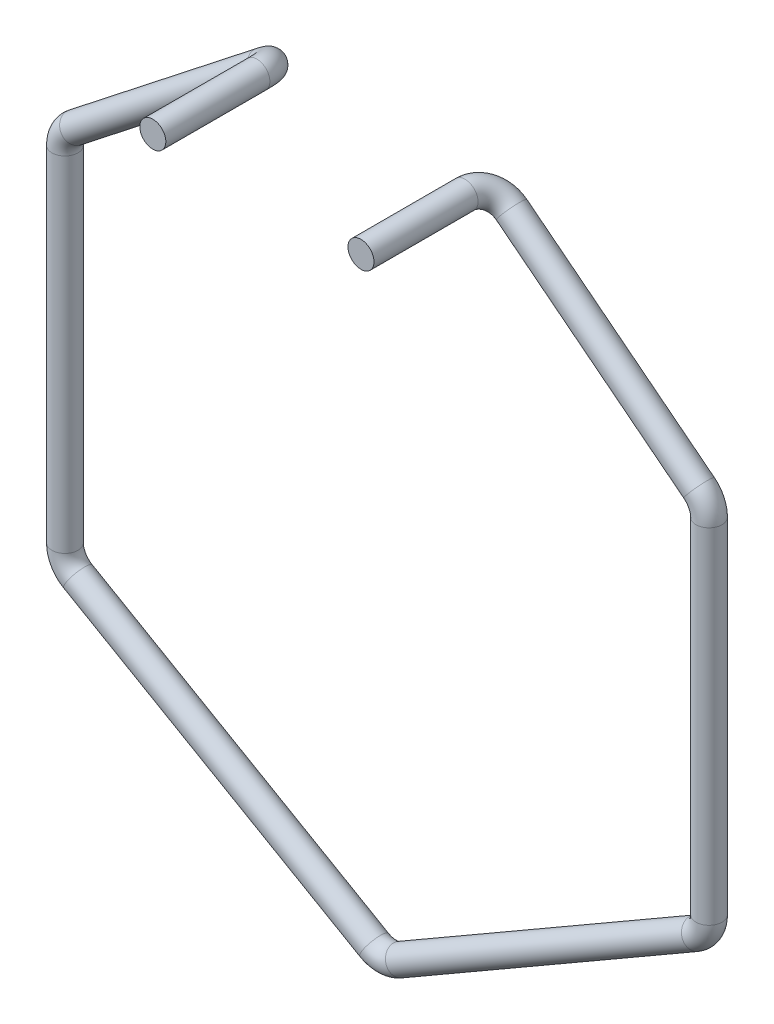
ISO-10303-21;
HEADER;
FILE_DESCRIPTION(('STEP AP214'),'2;1');
FILE_NAME('part.step','',(''),(''),'','','');
FILE_SCHEMA(('AUTOMOTIVE_DESIGN { 1 0 10303 214 1 1 1 1 }'));
ENDSEC;
DATA;
#1=APPLICATION_CONTEXT('core data for automotive mechanical design processes');
#2=APPLICATION_PROTOCOL_DEFINITION('international standard','automotive_design',2000,#1);
#3=PRODUCT_CONTEXT('',#1,'mechanical');
#4=PRODUCT('Part','Part','',(#3));
#5=PRODUCT_RELATED_PRODUCT_CATEGORY('part','',(#4));
#6=PRODUCT_DEFINITION_FORMATION('','',#4);
#7=PRODUCT_DEFINITION_CONTEXT('part definition',#1,'design');
#8=PRODUCT_DEFINITION('design','',#6,#7);
#9=PRODUCT_DEFINITION_SHAPE('','',#8);
#10=(LENGTH_UNIT() NAMED_UNIT(*) SI_UNIT(.MILLI.,.METRE.));
#11=(NAMED_UNIT(*) PLANE_ANGLE_UNIT() SI_UNIT($,.RADIAN.));
#12=(NAMED_UNIT(*) SI_UNIT($,.STERADIAN.) SOLID_ANGLE_UNIT());
#13=UNCERTAINTY_MEASURE_WITH_UNIT(LENGTH_MEASURE(1.E-05),#10,'distance_accuracy_value','');
#14=(GEOMETRIC_REPRESENTATION_CONTEXT(3) GLOBAL_UNCERTAINTY_ASSIGNED_CONTEXT((#13)) GLOBAL_UNIT_ASSIGNED_CONTEXT((#10,
#11,#12)) REPRESENTATION_CONTEXT('',''));
#15=CARTESIAN_POINT('',(0.,0.,0.));
#16=DIRECTION('',(0.,0.,1.));
#17=DIRECTION('',(1.,0.,0.));
#18=AXIS2_PLACEMENT_3D('',#15,#16,#17);
#19=CARTESIAN_POINT('',(24.,82.3229160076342,5.99999999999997));
#20=DIRECTION('',(0.,0.,1.));
#21=DIRECTION('',(0.,-1.,0.));
#22=AXIS2_PLACEMENT_3D('',#19,#20,#21);
#23=CYLINDRICAL_SURFACE('',#22,3.);
#24=CARTESIAN_POINT('',(24.,82.3229160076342,5.99999999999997));
#25=DIRECTION('',(0.,0.,-1.));
#26=DIRECTION('',(-1.,0.,0.));
#27=AXIS2_PLACEMENT_3D('',#24,#25,#26);
#28=CIRCLE('',#27,3.);
#29=CARTESIAN_POINT('',(21.6400553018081,84.1751203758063,5.99999999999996));
#30=VERTEX_POINT('',#29);
#31=EDGE_CURVE('E36',#30,#30,#28,.T.);
#32=ORIENTED_EDGE('',*,*,#31,.F.);
#33=EDGE_LOOP('',(#32));
#34=FACE_BOUND('',#33,.T.);
#35=CARTESIAN_POINT('',(24.,82.3229160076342,30.));
#36=DIRECTION('',(0.,0.,-1.));
#37=DIRECTION('',(-1.,0.,0.));
#38=AXIS2_PLACEMENT_3D('',#35,#36,#37);
#39=CIRCLE('',#38,3.);
#40=CARTESIAN_POINT('',(21.,82.3229160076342,30.));
#41=VERTEX_POINT('',#40);
#42=EDGE_CURVE('E10',#41,#41,#39,.T.);
#43=ORIENTED_EDGE('',*,*,#42,.T.);
#44=EDGE_LOOP('',(#43));
#45=FACE_BOUND('',#44,.T.);
#46=ADVANCED_FACE('F30',(#34,#45),#23,.T.);
#47=CARTESIAN_POINT('',(28.7198893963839,78.6185072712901,6.));
#48=DIRECTION('',(0.617401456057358,0.78664823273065,0.));
#49=DIRECTION('',(-0.786648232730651,0.617401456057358,0.));
#50=AXIS2_PLACEMENT_3D('',#47,#48,#49);
#51=TOROIDAL_SURFACE('',#50,6.,3.);
#52=CARTESIAN_POINT('',(28.7198893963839,78.6185072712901,0.));
#53=DIRECTION('',(0.786648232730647,-0.617401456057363,0.));
#54=DIRECTION('',(-0.381184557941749,-0.485677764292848,-0.78664823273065));
#55=AXIS2_PLACEMENT_3D('',#52,#53,#54);
#56=CIRCLE('',#55,3.);
#57=CARTESIAN_POINT('',(28.719889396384,78.6185072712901,-3.));
#58=VERTEX_POINT('',#57);
#59=EDGE_CURVE('E40',#58,#58,#56,.T.);
#60=CARTESIAN_POINT('',(28.7198893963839,78.6185072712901,6.));
#61=DIRECTION('',(0.617401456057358,0.78664823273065,0.));
#62=DIRECTION('',(-0.786648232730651,0.617401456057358,0.));
#63=AXIS2_PLACEMENT_3D('',#60,#61,#62);
#64=CIRCLE('',#63,9.);
#65=EDGE_CURVE('',#58,#30,#64,.T.);
#66=ORIENTED_EDGE('',*,*,#59,.F.);
#67=ORIENTED_EDGE('',*,*,#31,.T.);
#68=ORIENTED_EDGE('',*,*,#65,.T.);
#69=ORIENTED_EDGE('',*,*,#65,.F.);
#70=EDGE_LOOP('',(#66,#68,#67,#69));
#71=FACE_BOUND('',#70,.T.);
#72=ADVANCED_FACE('F104',(#71),#51,.T.);
#73=CARTESIAN_POINT('',(71.9660871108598,44.6766965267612,0.));
#74=DIRECTION('',(-0.786648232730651,0.617401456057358,0.));
#75=DIRECTION('',(-0.617401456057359,-0.78664823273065,0.));
#76=AXIS2_PLACEMENT_3D('',#73,#74,#75);
#77=CYLINDRICAL_SURFACE('',#76,3.);
#78=CARTESIAN_POINT('',(71.9660871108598,44.6766965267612,0.));
#79=DIRECTION('',(0.786648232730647,-0.617401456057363,0.));
#80=DIRECTION('',(-0.381184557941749,-0.485677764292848,-0.78664823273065));
#81=AXIS2_PLACEMENT_3D('',#78,#79,#80);
#82=CIRCLE('',#81,3.);
#83=CARTESIAN_POINT('',(73.8182914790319,47.0366412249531,0.));
#84=VERTEX_POINT('',#83);
#85=EDGE_CURVE('E44',#84,#84,#82,.T.);
#86=ORIENTED_EDGE('',*,*,#85,.F.);
#87=EDGE_LOOP('',(#86));
#88=FACE_BOUND('',#87,.T.);
#89=ORIENTED_EDGE('',*,*,#59,.T.);
#90=EDGE_LOOP('',(#89));
#91=FACE_BOUND('',#90,.T.);
#92=ADVANCED_FACE('F109',(#88,#91),#77,.T.);
#93=CARTESIAN_POINT('',(68.2616783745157,39.9568071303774,0.));
#94=DIRECTION('',(0.,0.,1.));
#95=DIRECTION('',(1.,0.,0.));
#96=AXIS2_PLACEMENT_3D('',#93,#94,#95);
#97=TOROIDAL_SURFACE('',#96,5.99999999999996,3.);
#98=CARTESIAN_POINT('',(74.2616783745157,39.9568071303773,0.));
#99=DIRECTION('',(0.,-1.,0.));
#100=DIRECTION('',(-0.617401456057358,0.,-0.78664823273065));
#101=AXIS2_PLACEMENT_3D('',#98,#99,#100);
#102=CIRCLE('',#101,3.);
#103=CARTESIAN_POINT('',(77.2616783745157,39.9568071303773,0.));
#104=VERTEX_POINT('',#103);
#105=EDGE_CURVE('E49',#104,#104,#102,.T.);
#106=CARTESIAN_POINT('',(68.2616783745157,39.9568071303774,0.));
#107=DIRECTION('',(0.,0.,1.));
#108=DIRECTION('',(1.,0.,0.));
#109=AXIS2_PLACEMENT_3D('',#106,#107,#108);
#110=CIRCLE('',#109,8.99999999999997);
#111=EDGE_CURVE('',#104,#84,#110,.T.);
#112=ORIENTED_EDGE('',*,*,#105,.F.);
#113=ORIENTED_EDGE('',*,*,#85,.T.);
#114=ORIENTED_EDGE('',*,*,#111,.T.);
#115=ORIENTED_EDGE('',*,*,#111,.F.);
#116=EDGE_LOOP('',(#112,#114,#113,#115));
#117=FACE_BOUND('',#116,.T.);
#118=ADVANCED_FACE('F114',(#117),#97,.T.);
#119=CARTESIAN_POINT('',(74.2616783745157,-39.4108983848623,0.));
#120=DIRECTION('',(0.,1.,0.));
#121=DIRECTION('',(-1.,0.,0.));
#122=AXIS2_PLACEMENT_3D('',#119,#120,#121);
#123=CYLINDRICAL_SURFACE('',#122,3.);
#124=CARTESIAN_POINT('',(74.2616783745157,-39.4108983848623,0.));
#125=DIRECTION('',(0.,-1.,0.));
#126=DIRECTION('',(-0.617401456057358,0.,-0.78664823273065));
#127=AXIS2_PLACEMENT_3D('',#124,#125,#126);
#128=CIRCLE('',#127,3.);
#129=CARTESIAN_POINT('',(77.2616783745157,-39.4108983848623,0.));
#130=VERTEX_POINT('',#129);
#131=EDGE_CURVE('E52',#130,#130,#128,.T.);
#132=ORIENTED_EDGE('',*,*,#131,.F.);
#133=EDGE_LOOP('',(#132));
#134=FACE_BOUND('',#133,.T.);
#135=ORIENTED_EDGE('',*,*,#105,.T.);
#136=EDGE_LOOP('',(#135));
#137=FACE_BOUND('',#136,.T.);
#138=ADVANCED_FACE('F121',(#134,#137),#123,.T.);
#139=CARTESIAN_POINT('',(68.2616783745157,-39.4108983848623,0.));
#140=DIRECTION('',(0.,0.,1.));
#141=DIRECTION('',(1.,0.,0.));
#142=AXIS2_PLACEMENT_3D('',#139,#140,#141);
#143=TOROIDAL_SURFACE('',#142,5.99999999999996,3.);
#144=CARTESIAN_POINT('',(71.2616783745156,-44.6070508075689,0.));
#145=DIRECTION('',(-0.866025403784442,-0.499999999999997,0.));
#146=DIRECTION('',(-0.308700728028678,0.534685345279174,-0.78664823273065));
#147=AXIS2_PLACEMENT_3D('',#144,#145,#146);
#148=CIRCLE('',#147,3.);
#149=CARTESIAN_POINT('',(72.7616783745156,-47.2051270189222,0.));
#150=VERTEX_POINT('',#149);
#151=EDGE_CURVE('E55',#150,#150,#148,.T.);
#152=CARTESIAN_POINT('',(68.2616783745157,-39.4108983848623,0.));
#153=DIRECTION('',(0.,0.,1.));
#154=DIRECTION('',(1.,0.,0.));
#155=AXIS2_PLACEMENT_3D('',#152,#153,#154);
#156=CIRCLE('',#155,8.99999999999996);
#157=EDGE_CURVE('',#150,#130,#156,.T.);
#158=ORIENTED_EDGE('',*,*,#151,.F.);
#159=ORIENTED_EDGE('',*,*,#131,.T.);
#160=ORIENTED_EDGE('',*,*,#157,.T.);
#161=ORIENTED_EDGE('',*,*,#157,.F.);
#162=EDGE_LOOP('',(#158,#160,#159,#161));
#163=FACE_BOUND('',#162,.T.);
#164=ADVANCED_FACE('F125',(#163),#143,.T.);
#165=CARTESIAN_POINT('',(2.99999999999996,-84.017949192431,0.));
#166=DIRECTION('',(0.86602540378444,0.5,0.));
#167=DIRECTION('',(-0.5,0.866025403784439,0.));
#168=AXIS2_PLACEMENT_3D('',#165,#166,#167);
#169=CYLINDRICAL_SURFACE('',#168,3.);
#170=CARTESIAN_POINT('',(2.99999999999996,-84.017949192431,0.));
#171=DIRECTION('',(-0.866025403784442,-0.499999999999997,0.));
#172=DIRECTION('',(-0.308700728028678,0.534685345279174,-0.78664823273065));
#173=AXIS2_PLACEMENT_3D('',#170,#171,#172);
#174=CIRCLE('',#173,3.);
#175=CARTESIAN_POINT('',(4.49999999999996,-86.6160254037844,0.));
#176=VERTEX_POINT('',#175);
#177=EDGE_CURVE('E58',#176,#176,#174,.T.);
#178=ORIENTED_EDGE('',*,*,#177,.F.);
#179=EDGE_LOOP('',(#178));
#180=FACE_BOUND('',#179,.T.);
#181=ORIENTED_EDGE('',*,*,#151,.T.);
#182=EDGE_LOOP('',(#181));
#183=FACE_BOUND('',#182,.T.);
#184=ADVANCED_FACE('F129',(#180,#183),#169,.T.);
#185=CARTESIAN_POINT('',(0.,-78.8217967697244,0.));
#186=DIRECTION('',(0.,0.,1.));
#187=DIRECTION('',(1.,0.,0.));
#188=AXIS2_PLACEMENT_3D('',#185,#186,#187);
#189=TOROIDAL_SURFACE('',#188,5.99999999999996,3.);
#190=CARTESIAN_POINT('',(-3.00000000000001,-84.017949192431,0.));
#191=DIRECTION('',(-0.866025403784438,0.500000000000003,0.));
#192=DIRECTION('',(0.30870072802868,0.534685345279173,-0.78664823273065));
#193=AXIS2_PLACEMENT_3D('',#190,#191,#192);
#194=CIRCLE('',#193,3.);
#195=CARTESIAN_POINT('',(-4.50000000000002,-86.6160254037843,0.));
#196=VERTEX_POINT('',#195);
#197=EDGE_CURVE('E61',#196,#196,#194,.T.);
#198=CARTESIAN_POINT('',(0.,-78.8217967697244,0.));
#199=DIRECTION('',(0.,0.,1.));
#200=DIRECTION('',(1.,0.,0.));
#201=AXIS2_PLACEMENT_3D('',#198,#199,#200);
#202=CIRCLE('',#201,8.99999999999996);
#203=EDGE_CURVE('',#196,#176,#202,.T.);
#204=ORIENTED_EDGE('',*,*,#197,.F.);
#205=ORIENTED_EDGE('',*,*,#177,.T.);
#206=ORIENTED_EDGE('',*,*,#203,.T.);
#207=ORIENTED_EDGE('',*,*,#203,.F.);
#208=EDGE_LOOP('',(#204,#206,#205,#207));
#209=FACE_BOUND('',#208,.T.);
#210=ADVANCED_FACE('F133',(#209),#189,.T.);
#211=CARTESIAN_POINT('',(-71.2616783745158,-44.6070508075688,0.));
#212=DIRECTION('',(0.86602540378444,-0.5,0.));
#213=DIRECTION('',(0.500000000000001,0.866025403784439,0.));
#214=AXIS2_PLACEMENT_3D('',#211,#212,#213);
#215=CYLINDRICAL_SURFACE('',#214,3.);
#216=CARTESIAN_POINT('',(-71.2616783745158,-44.6070508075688,0.));
#217=DIRECTION('',(-0.866025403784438,0.500000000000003,0.));
#218=DIRECTION('',(0.30870072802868,0.534685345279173,-0.78664823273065));
#219=AXIS2_PLACEMENT_3D('',#216,#217,#218);
#220=CIRCLE('',#219,3.);
#221=CARTESIAN_POINT('',(-72.7616783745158,-47.2051270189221,0.));
#222=VERTEX_POINT('',#221);
#223=EDGE_CURVE('E64',#222,#222,#220,.T.);
#224=ORIENTED_EDGE('',*,*,#223,.F.);
#225=EDGE_LOOP('',(#224));
#226=FACE_BOUND('',#225,.T.);
#227=ORIENTED_EDGE('',*,*,#197,.T.);
#228=EDGE_LOOP('',(#227));
#229=FACE_BOUND('',#228,.T.);
#230=ADVANCED_FACE('F137',(#226,#229),#215,.T.);
#231=CARTESIAN_POINT('',(-68.2616783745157,-39.4108983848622,0.));
#232=DIRECTION('',(0.,0.,1.));
#233=DIRECTION('',(1.,0.,0.));
#234=AXIS2_PLACEMENT_3D('',#231,#232,#233);
#235=TOROIDAL_SURFACE('',#234,5.99999999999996,3.);
#236=CARTESIAN_POINT('',(-74.2616783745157,-39.4108983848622,0.));
#237=DIRECTION('',(0.,1.,0.));
#238=DIRECTION('',(0.617401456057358,0.,-0.786648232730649));
#239=AXIS2_PLACEMENT_3D('',#236,#237,#238);
#240=CIRCLE('',#239,3.);
#241=CARTESIAN_POINT('',(-77.2616783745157,-39.4108983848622,0.));
#242=VERTEX_POINT('',#241);
#243=EDGE_CURVE('E67',#242,#242,#240,.T.);
#244=CARTESIAN_POINT('',(-68.2616783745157,-39.4108983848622,0.));
#245=DIRECTION('',(0.,0.,1.));
#246=DIRECTION('',(1.,0.,0.));
#247=AXIS2_PLACEMENT_3D('',#244,#245,#246);
#248=CIRCLE('',#247,8.99999999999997);
#249=EDGE_CURVE('',#242,#222,#248,.T.);
#250=ORIENTED_EDGE('',*,*,#243,.F.);
#251=ORIENTED_EDGE('',*,*,#223,.T.);
#252=ORIENTED_EDGE('',*,*,#249,.T.);
#253=ORIENTED_EDGE('',*,*,#249,.F.);
#254=EDGE_LOOP('',(#250,#252,#251,#253));
#255=FACE_BOUND('',#254,.T.);
#256=ADVANCED_FACE('F141',(#255),#235,.T.);
#257=CARTESIAN_POINT('',(-74.2616783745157,39.9568071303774,0.));
#258=DIRECTION('',(0.,-1.,0.));
#259=DIRECTION('',(0.,0.,-1.));
#260=AXIS2_PLACEMENT_3D('',#257,#258,#259);
#261=CYLINDRICAL_SURFACE('',#260,3.);
#262=CARTESIAN_POINT('',(-74.2616783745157,39.9568071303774,0.));
#263=DIRECTION('',(0.,1.,0.));
#264=DIRECTION('',(0.617401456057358,0.,-0.786648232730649));
#265=AXIS2_PLACEMENT_3D('',#262,#263,#264);
#266=CIRCLE('',#265,3.);
#267=CARTESIAN_POINT('',(-77.2616783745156,39.9568071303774,0.));
#268=VERTEX_POINT('',#267);
#269=EDGE_CURVE('E70',#268,#268,#266,.T.);
#270=ORIENTED_EDGE('',*,*,#269,.F.);
#271=EDGE_LOOP('',(#270));
#272=FACE_BOUND('',#271,.T.);
#273=ORIENTED_EDGE('',*,*,#243,.T.);
#274=EDGE_LOOP('',(#273));
#275=FACE_BOUND('',#274,.T.);
#276=ADVANCED_FACE('F145',(#272,#275),#261,.T.);
#277=CARTESIAN_POINT('',(-68.2616783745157,39.9568071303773,0.));
#278=DIRECTION('',(0.,0.,1.));
#279=DIRECTION('',(1.,0.,0.));
#280=AXIS2_PLACEMENT_3D('',#277,#278,#279);
#281=TOROIDAL_SURFACE('',#280,5.99999999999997,3.);
#282=CARTESIAN_POINT('',(-71.9660871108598,44.6766965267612,0.));
#283=DIRECTION('',(0.786648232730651,0.617401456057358,0.));
#284=DIRECTION('',(0.381184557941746,-0.48567776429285,-0.786648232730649));
#285=AXIS2_PLACEMENT_3D('',#282,#283,#284);
#286=CIRCLE('',#285,3.);
#287=CARTESIAN_POINT('',(-73.8182914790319,47.0366412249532,0.));
#288=VERTEX_POINT('',#287);
#289=EDGE_CURVE('E73',#288,#288,#286,.T.);
#290=CARTESIAN_POINT('',(-68.2616783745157,39.9568071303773,0.));
#291=DIRECTION('',(0.,0.,1.));
#292=DIRECTION('',(1.,0.,0.));
#293=AXIS2_PLACEMENT_3D('',#290,#291,#292);
#294=CIRCLE('',#293,8.99999999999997);
#295=EDGE_CURVE('',#288,#268,#294,.T.);
#296=ORIENTED_EDGE('',*,*,#289,.F.);
#297=ORIENTED_EDGE('',*,*,#269,.T.);
#298=ORIENTED_EDGE('',*,*,#295,.T.);
#299=ORIENTED_EDGE('',*,*,#295,.F.);
#300=EDGE_LOOP('',(#296,#298,#297,#299));
#301=FACE_BOUND('',#300,.T.);
#302=ADVANCED_FACE('F149',(#301),#281,.T.);
#303=CARTESIAN_POINT('',(-28.7198893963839,78.6185072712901,0.));
#304=DIRECTION('',(-0.786648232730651,-0.617401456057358,0.));
#305=DIRECTION('',(0.617401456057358,-0.78664823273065,0.));
#306=AXIS2_PLACEMENT_3D('',#303,#304,#305);
#307=CYLINDRICAL_SURFACE('',#306,3.);
#308=CARTESIAN_POINT('',(-28.7198893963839,78.6185072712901,0.));
#309=DIRECTION('',(0.786648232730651,0.617401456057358,0.));
#310=DIRECTION('',(0.381184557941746,-0.48567776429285,-0.786648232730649));
#311=AXIS2_PLACEMENT_3D('',#308,#309,#310);
#312=CIRCLE('',#311,3.);
#313=CARTESIAN_POINT('',(-28.7198893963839,78.6185072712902,-3.00000000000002));
#314=VERTEX_POINT('',#313);
#315=EDGE_CURVE('E76',#314,#314,#312,.T.);
#316=ORIENTED_EDGE('',*,*,#315,.F.);
#317=EDGE_LOOP('',(#316));
#318=FACE_BOUND('',#317,.T.);
#319=ORIENTED_EDGE('',*,*,#289,.T.);
#320=EDGE_LOOP('',(#319));
#321=FACE_BOUND('',#320,.T.);
#322=ADVANCED_FACE('F100',(#318,#321),#307,.T.);
#323=CARTESIAN_POINT('',(-28.7198893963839,78.61850727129,5.99999999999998));
#324=DIRECTION('',(-0.617401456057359,0.78664823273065,0.));
#325=DIRECTION('',(-0.786648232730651,-0.617401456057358,0.));
#326=AXIS2_PLACEMENT_3D('',#323,#324,#325);
#327=TOROIDAL_SURFACE('',#326,6.,3.);
#328=CARTESIAN_POINT('',(-24.,82.3229160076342,6.));
#329=DIRECTION('',(0.,0.,1.));
#330=DIRECTION('',(1.,0.,0.));
#331=AXIS2_PLACEMENT_3D('',#328,#329,#330);
#332=CIRCLE('',#331,3.);
#333=CARTESIAN_POINT('',(-21.6400553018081,84.1751203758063,6.00000000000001));
#334=VERTEX_POINT('',#333);
#335=EDGE_CURVE('E79',#334,#334,#332,.T.);
#336=CARTESIAN_POINT('',(-28.7198893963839,78.61850727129,5.99999999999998));
#337=DIRECTION('',(-0.617401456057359,0.78664823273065,0.));
#338=DIRECTION('',(-0.786648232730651,-0.617401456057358,0.));
#339=AXIS2_PLACEMENT_3D('',#336,#337,#338);
#340=CIRCLE('',#339,9.);
#341=EDGE_CURVE('',#334,#314,#340,.T.);
#342=ORIENTED_EDGE('',*,*,#335,.F.);
#343=ORIENTED_EDGE('',*,*,#315,.T.);
#344=ORIENTED_EDGE('',*,*,#341,.T.);
#345=ORIENTED_EDGE('',*,*,#341,.F.);
#346=EDGE_LOOP('',(#342,#344,#343,#345));
#347=FACE_BOUND('',#346,.T.);
#348=ADVANCED_FACE('F91',(#347),#327,.T.);
#349=CARTESIAN_POINT('',(-24.,82.3229160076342,6.));
#350=DIRECTION('',(0.,0.,1.));
#351=DIRECTION('',(0.,-1.,0.));
#352=AXIS2_PLACEMENT_3D('',#349,#350,#351);
#353=CYLINDRICAL_SURFACE('',#352,3.);
#354=ORIENTED_EDGE('',*,*,#335,.T.);
#355=EDGE_LOOP('',(#354));
#356=FACE_BOUND('',#355,.T.);
#357=CARTESIAN_POINT('',(-24.,82.3229160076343,30.));
#358=DIRECTION('',(0.,0.,1.));
#359=DIRECTION('',(1.,0.,0.));
#360=AXIS2_PLACEMENT_3D('',#357,#358,#359);
#361=CIRCLE('',#360,3.);
#362=CARTESIAN_POINT('',(-21.,82.3229160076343,30.));
#363=VERTEX_POINT('',#362);
#364=EDGE_CURVE('E82',#363,#363,#361,.T.);
#365=ORIENTED_EDGE('',*,*,#364,.F.);
#366=EDGE_LOOP('',(#365));
#367=FACE_BOUND('',#366,.T.);
#368=ADVANCED_FACE('F88',(#356,#367),#353,.T.);
#369=CARTESIAN_POINT('',(24.,82.3229160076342,30.));
#370=DIRECTION('',(0.,0.,-1.));
#371=DIRECTION('',(-1.,0.,0.));
#372=AXIS2_PLACEMENT_3D('',#369,#370,#371);
#373=PLANE('',#372);
#374=ORIENTED_EDGE('',*,*,#42,.F.);
#375=EDGE_LOOP('',(#374));
#376=FACE_BOUND('',#375,.T.);
#377=ADVANCED_FACE('F90',(#376),#373,.F.);
#378=CARTESIAN_POINT('',(-24.,82.3229160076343,30.));
#379=DIRECTION('',(0.,0.,1.));
#380=DIRECTION('',(1.,0.,0.));
#381=AXIS2_PLACEMENT_3D('',#378,#379,#380);
#382=PLANE('',#381);
#383=ORIENTED_EDGE('',*,*,#364,.T.);
#384=EDGE_LOOP('',(#383));
#385=FACE_BOUND('',#384,.T.);
#386=ADVANCED_FACE('F86',(#385),#382,.T.);
#387=CLOSED_SHELL('',(#46,#72,#92,#118,#138,#164,#184,#210,#230,#256,#276,#302,#322,#348,#368,
#377,#386));
#388=MANIFOLD_SOLID_BREP('B2',#387);
#389=ADVANCED_BREP_SHAPE_REPRESENTATION('',(#18,#388),#14);
#390=SHAPE_DEFINITION_REPRESENTATION(#9,#389);
ENDSEC;
END-ISO-10303-21;
